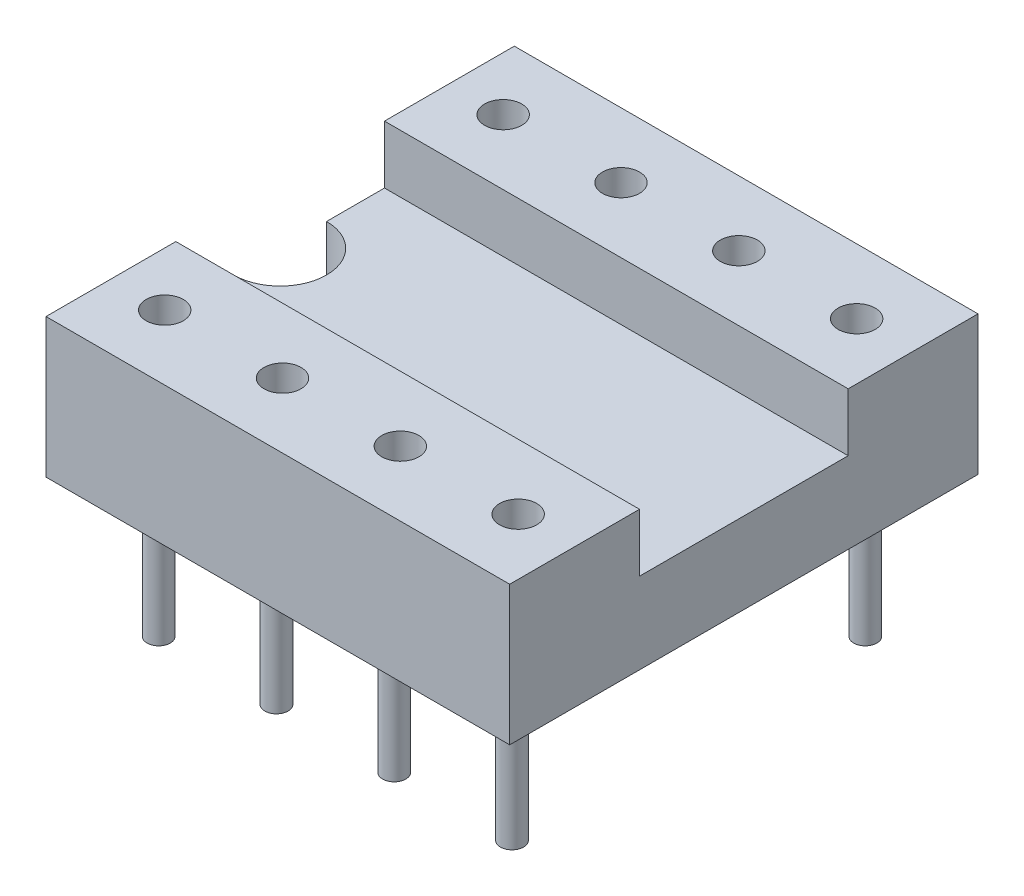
from build123d import *

# Parameters (mm, degrees)
EXTRUSION1_DEPTH        = 10
ENL_V_MAT_EXTRU_1_DEPTH = 12.338650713
ESQUISSE3_R             = 0.4
ENL_V_MAT_EXTRU_2_DEPTH = 2.5
ESQUISSE5_R             = 0.25
EXTRUSION2_DEPTH        = 3


with BuildPart() as part:
    # Esquisse1 → Extrusion1 (new body)
    with BuildSketch(Plane(origin=(0, 0, 0), x_dir=(0, 0, -1), z_dir=(1, 0, 0))):
        Polygon((-2.25, 1.75), (-2.25, 3), (-5.05, 3), (-5.05, 0), (5.05, 0), (5.05, 3), (2.25, 3), (2.25, 1.75), align=None)
    extrude(amount=EXTRUSION1_DEPTH)

    # Esquisse2 → Enl_v. mat.-Extru.1 (cut, through all)
    with BuildSketch(Plane(origin=(0, 1.75, 0), x_dir=(-1, 0, 0), z_dir=(0, 1, 0))):
        with BuildLine():
            Line((0, -1), (0, 1))
            ThreePointArc((0, 1), (-1, 0), (0, -1))
        make_face()
    extrude(amount=-ENL_V_MAT_EXTRU_1_DEPTH, mode=Mode.SUBTRACT)

    # Esquisse3 → Enl_v. mat.-Extru.2 (cut)
    with BuildSketch(Plane(origin=(0, 3, 0), x_dir=(-1, 0, 0), z_dir=(0, 1, 0))):
        with Locations(Location((-1.16, 3.65, 0), (0, 0, 90))):
            Circle(ESQUISSE3_R)
        with Locations(Location((-1.16, -3.65, 0), (0, 0, 270))):
            Circle(ESQUISSE3_R)
        with Locations(Location((-3.701, 3.65, 0), (0, 0, 90))):
            Circle(ESQUISSE3_R)
        with Locations(Location((-3.701, -3.65, 0), (0, 0, 270))):
            Circle(ESQUISSE3_R)
        with Locations(Location((-6.242, 3.65, 0), (0, 0, 90))):
            Circle(ESQUISSE3_R)
        with Locations(Location((-6.242, -3.65, 0), (0, 0, 270))):
            Circle(ESQUISSE3_R)
        with Locations(Location((-8.783, 3.65, 0), (0, 0, 90))):
            Circle(ESQUISSE3_R)
        with Locations(Location((-8.783, -3.65, 0), (0, 0, 270))):
            Circle(ESQUISSE3_R)
    extrude(amount=-ENL_V_MAT_EXTRU_2_DEPTH, mode=Mode.SUBTRACT)

    # Esquisse5 → Extrusion2 (add)
    with BuildSketch(Plane.XZ):
        with Locations(Location((1.19, 3.81, 0), (0, 0, 90))):
            Circle(ESQUISSE5_R)
        with Locations(Location((1.19, -3.81, 0), (0, 0, 90))):
            Circle(ESQUISSE5_R)
        with Locations(Location((3.73, -3.81, 0), (0, 0, 90))):
            Circle(ESQUISSE5_R)
        with Locations(Location((3.73, 3.81, 0), (0, 0, 90))):
            Circle(ESQUISSE5_R)
        with Locations(Location((6.27, -3.81, 0), (0, 0, 90))):
            Circle(ESQUISSE5_R)
        with Locations(Location((6.27, 3.81, 0), (0, 0, 90))):
            Circle(ESQUISSE5_R)
        with Locations(Location((8.81, -3.81, 0), (0, 0, 90))):
            Circle(ESQUISSE5_R)
        with Locations(Location((8.81, 3.81, 0), (0, 0, 90))):
            Circle(ESQUISSE5_R)
    extrude(amount=EXTRUSION2_DEPTH)


solid = part.part
